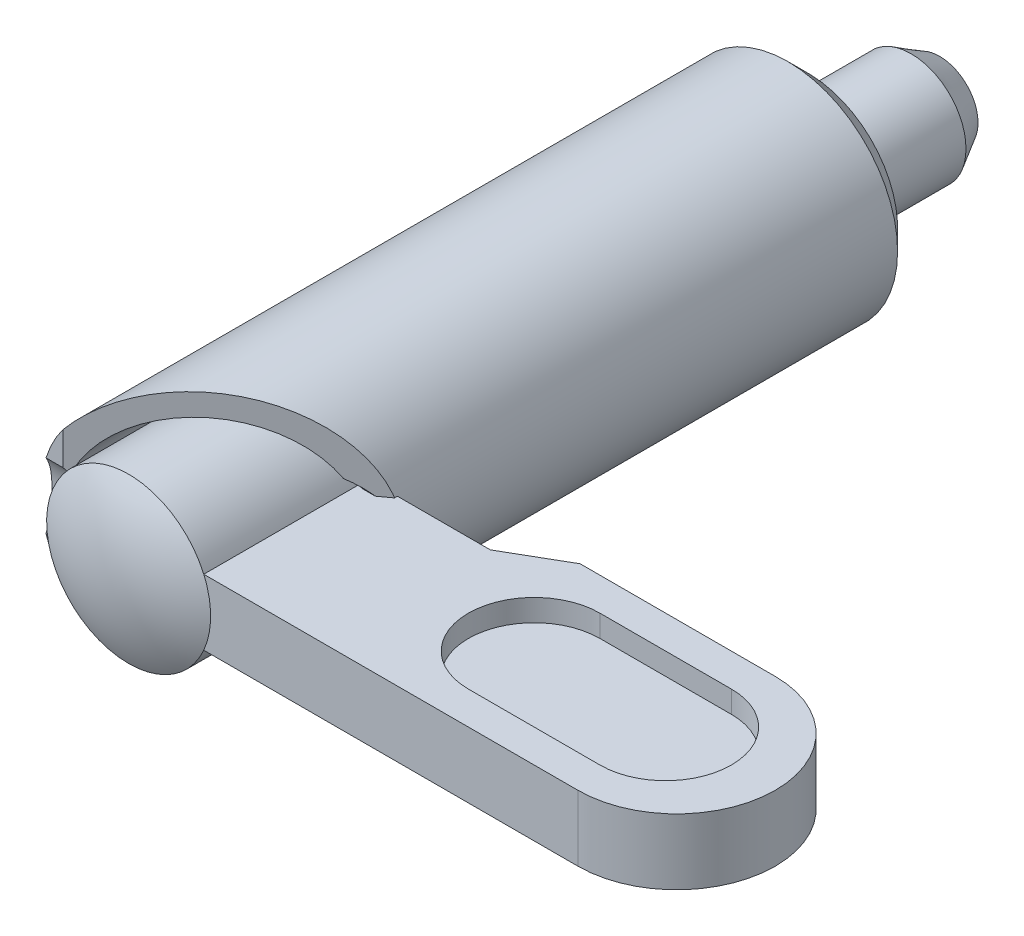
ISO-10303-21;
HEADER;
FILE_DESCRIPTION(('STEP AP214'),'2;1');
FILE_NAME('part.step','',(''),(''),'','','');
FILE_SCHEMA(('AUTOMOTIVE_DESIGN { 1 0 10303 214 1 1 1 1 }'));
ENDSEC;
DATA;
#1=APPLICATION_CONTEXT('core data for automotive mechanical design processes');
#2=APPLICATION_PROTOCOL_DEFINITION('international standard','automotive_design',2000,#1);
#3=PRODUCT_CONTEXT('',#1,'mechanical');
#4=PRODUCT('Part','Part','',(#3));
#5=PRODUCT_RELATED_PRODUCT_CATEGORY('part','',(#4));
#6=PRODUCT_DEFINITION_FORMATION('','',#4);
#7=PRODUCT_DEFINITION_CONTEXT('part definition',#1,'design');
#8=PRODUCT_DEFINITION('design','',#6,#7);
#9=PRODUCT_DEFINITION_SHAPE('','',#8);
#10=(LENGTH_UNIT() NAMED_UNIT(*) SI_UNIT(.MILLI.,.METRE.));
#11=(NAMED_UNIT(*) PLANE_ANGLE_UNIT() SI_UNIT($,.RADIAN.));
#12=(NAMED_UNIT(*) SI_UNIT($,.STERADIAN.) SOLID_ANGLE_UNIT());
#13=UNCERTAINTY_MEASURE_WITH_UNIT(LENGTH_MEASURE(1.E-05),#10,'distance_accuracy_value','');
#14=(GEOMETRIC_REPRESENTATION_CONTEXT(3) GLOBAL_UNCERTAINTY_ASSIGNED_CONTEXT((#13)) GLOBAL_UNIT_ASSIGNED_CONTEXT((#10,
#11,#12)) REPRESENTATION_CONTEXT('',''));
#15=CARTESIAN_POINT('',(0.,0.,0.));
#16=DIRECTION('',(0.,0.,1.));
#17=DIRECTION('',(1.,0.,0.));
#18=AXIS2_PLACEMENT_3D('',#15,#16,#17);
#19=CARTESIAN_POINT('',(-4.,-4.04800210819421,23.));
#20=DIRECTION('',(0.,0.,1.));
#21=DIRECTION('',(1.,0.,0.));
#22=AXIS2_PLACEMENT_3D('',#19,#20,#21);
#23=PLANE('',#22);
#24=CARTESIAN_POINT('',(0.,-1.60608234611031E-13,23.));
#25=DIRECTION('',(0.,0.,1.));
#26=DIRECTION('',(-1.,0.,0.));
#27=AXIS2_PLACEMENT_3D('',#24,#25,#26);
#28=CIRCLE('',#27,4.);
#29=CARTESIAN_POINT('',(-4.,-1.60608234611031E-13,23.));
#30=VERTEX_POINT('',#29);
#31=EDGE_CURVE('E398',#30,#30,#28,.F.);
#32=ORIENTED_EDGE('',*,*,#31,.F.);
#33=EDGE_LOOP('',(#32));
#34=FACE_BOUND('',#33,.T.);
#35=CARTESIAN_POINT('',(0.,-1.60608234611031E-13,23.));
#36=DIRECTION('',(0.,0.,1.));
#37=DIRECTION('',(0.,-1.,0.));
#38=AXIS2_PLACEMENT_3D('',#35,#36,#37);
#39=CIRCLE('',#38,3.74165738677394);
#40=CARTESIAN_POINT('',(0.,-3.7416573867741,23.));
#41=VERTEX_POINT('',#40);
#42=EDGE_CURVE('E325',#41,#41,#39,.F.);
#43=ORIENTED_EDGE('',*,*,#42,.T.);
#44=EDGE_LOOP('',(#43));
#45=FACE_BOUND('',#44,.T.);
#46=ADVANCED_FACE('F14',(#34,#45),#23,.T.);
#47=CARTESIAN_POINT('',(1.74944465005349,-1.77044009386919,-6.));
#48=DIRECTION('',(0.,0.,-1.));
#49=DIRECTION('',(-1.,0.,0.));
#50=AXIS2_PLACEMENT_3D('',#47,#48,#49);
#51=PLANE('',#50);
#52=CARTESIAN_POINT('',(0.,0.,-6.00000000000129));
#53=DIRECTION('',(0.,0.,1.));
#54=DIRECTION('',(0.,-1.,0.));
#55=AXIS2_PLACEMENT_3D('',#52,#53,#54);
#56=CIRCLE('',#55,1.74944465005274);
#57=CARTESIAN_POINT('',(0.,-1.7494446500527,-6.0000000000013));
#58=VERTEX_POINT('',#57);
#59=EDGE_CURVE('E402',#58,#58,#56,.T.);
#60=ORIENTED_EDGE('',*,*,#59,.F.);
#61=EDGE_LOOP('',(#60));
#62=FACE_BOUND('',#61,.T.);
#63=ADVANCED_FACE('F545',(#62),#51,.T.);
#64=CARTESIAN_POINT('',(0.,0.,-6.00000000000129));
#65=DIRECTION('',(0.,0.,1.));
#66=DIRECTION('',(0.,-1.,0.));
#67=AXIS2_PLACEMENT_3D('',#64,#65,#66);
#68=CONICAL_SURFACE('',#67,1.74944465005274,0.523598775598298);
#69=CARTESIAN_POINT('',(0.,0.,-4.70000000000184));
#70=DIRECTION('',(0.,0.,1.));
#71=DIRECTION('',(1.,0.,0.));
#72=AXIS2_PLACEMENT_3D('',#69,#70,#71);
#73=CIRCLE('',#72,2.5);
#74=CARTESIAN_POINT('',(2.5,0.,-4.70000000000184));
#75=VERTEX_POINT('',#74);
#76=EDGE_CURVE('E401',#75,#75,#73,.T.);
#77=ORIENTED_EDGE('',*,*,#76,.F.);
#78=EDGE_LOOP('',(#77));
#79=FACE_BOUND('',#78,.T.);
#80=ORIENTED_EDGE('',*,*,#59,.T.);
#81=EDGE_LOOP('',(#80));
#82=FACE_BOUND('',#81,.T.);
#83=ADVANCED_FACE('F542',(#79,#82),#68,.T.);
#84=CARTESIAN_POINT('',(0.,0.,1.84E-12));
#85=DIRECTION('',(0.,0.,1.));
#86=DIRECTION('',(-1.,0.,0.));
#87=AXIS2_PLACEMENT_3D('',#84,#85,#86);
#88=CYLINDRICAL_SURFACE('',#87,2.5);
#89=CARTESIAN_POINT('',(0.,0.,1.8401079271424E-12));
#90=DIRECTION('',(0.,0.,1.));
#91=DIRECTION('',(-1.,0.,0.));
#92=AXIS2_PLACEMENT_3D('',#89,#90,#91);
#93=CIRCLE('',#92,2.5);
#94=CARTESIAN_POINT('',(-2.5,0.,1.8401079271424E-12));
#95=VERTEX_POINT('',#94);
#96=EDGE_CURVE('E397',#95,#95,#93,.T.);
#97=ORIENTED_EDGE('',*,*,#96,.F.);
#98=EDGE_LOOP('',(#97));
#99=FACE_BOUND('',#98,.T.);
#100=ORIENTED_EDGE('',*,*,#76,.T.);
#101=EDGE_LOOP('',(#100));
#102=FACE_BOUND('',#101,.T.);
#103=ADVANCED_FACE('F536',(#99,#102),#88,.T.);
#104=CARTESIAN_POINT('',(3.41739827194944,-1.81557134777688E-13,26.));
#105=DIRECTION('',(1.,0.,0.));
#106=DIRECTION('',(0.,0.,1.));
#107=AXIS2_PLACEMENT_3D('',#104,#105,#106);
#108=CYLINDRICAL_SURFACE('',#107,2.5);
#109=CARTESIAN_POINT('',(1.50552768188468,-1.81557134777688E-13,26.));
#110=DIRECTION('',(0.587785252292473,0.,0.809016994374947));
#111=DIRECTION('',(0.809016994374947,0.,-0.587785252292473));
#112=AXIS2_PLACEMENT_3D('',#109,#110,#111);
#113=ELLIPSE('',#112,4.2532540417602,2.5);
#114=CARTESIAN_POINT('',(3.41757756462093,2.07850032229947,24.6108144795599));
#115=VERTEX_POINT('',#114);
#116=CARTESIAN_POINT('',(3.4175776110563,-2.07850024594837,24.6108143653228));
#117=VERTEX_POINT('',#116);
#118=EDGE_CURVE('E527',#115,#117,#113,.F.);
#119=ORIENTED_EDGE('',*,*,#118,.F.);
#120=CARTESIAN_POINT('',(3.41757763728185,-2.07850020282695,24.6108143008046));
#121=CARTESIAN_POINT('',(3.44204013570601,-2.0382822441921,24.5506579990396));
#122=CARTESIAN_POINT('',(3.46702816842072,-1.99559149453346,24.4924201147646));
#123=CARTESIAN_POINT('',(3.51739313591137,-1.90541594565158,24.3799384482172));
#124=CARTESIAN_POINT('',(3.54277015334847,-1.85793011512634,24.3256955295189));
#125=CARTESIAN_POINT('',(3.61878673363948,-1.70791915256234,24.1685878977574));
#126=CARTESIAN_POINT('',(3.66899266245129,-1.59834169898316,24.0720930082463));
#127=CARTESIAN_POINT('',(3.76318752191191,-1.36184369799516,23.8983533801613));
#128=CARTESIAN_POINT('',(3.80715987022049,-1.23487859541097,23.8211595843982));
#129=CARTESIAN_POINT('',(3.86468142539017,-1.03397246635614,23.7226206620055));
#130=CARTESIAN_POINT('',(3.88243252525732,-0.965351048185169,23.6926757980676));
#131=CARTESIAN_POINT('',(3.91465106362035,-0.825036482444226,23.6388648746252));
#132=CARTESIAN_POINT('',(3.92911955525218,-0.753344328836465,23.6149968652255));
#133=CARTESIAN_POINT('',(3.96060532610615,-0.57088733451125,23.5634024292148));
#134=CARTESIAN_POINT('',(3.97527425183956,-0.458524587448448,23.5397232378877));
#135=CARTESIAN_POINT('',(3.99497385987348,-0.230783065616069,23.5080192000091));
#136=CARTESIAN_POINT('',(4.00000365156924,-0.115404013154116,23.4999957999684));
#137=CARTESIAN_POINT('',(3.99999597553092,0.127189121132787,23.5000046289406));
#138=CARTESIAN_POINT('',(3.99387798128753,0.254408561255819,23.509760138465));
#139=CARTESIAN_POINT('',(3.97001485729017,0.50480872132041,23.5482170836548));
#140=CARTESIAN_POINT('',(3.95226550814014,0.627987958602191,23.5769253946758));
#141=CARTESIAN_POINT('',(3.9069277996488,0.866361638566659,23.6516052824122));
#142=CARTESIAN_POINT('',(3.8793850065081,0.981590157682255,23.6974969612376));
#143=CARTESIAN_POINT('',(3.81672324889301,1.20242398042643,23.8047166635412));
#144=CARTESIAN_POINT('',(3.7815982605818,1.30802153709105,23.8660569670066));
#145=CARTESIAN_POINT('',(3.70335012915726,1.51609307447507,24.0078705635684));
#146=CARTESIAN_POINT('',(3.65980996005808,1.61762444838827,24.0894897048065));
#147=CARTESIAN_POINT('',(3.57049238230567,1.8062225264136,24.2667111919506));
#148=CARTESIAN_POINT('',(3.52471811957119,1.89330885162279,24.3622942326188));
#149=CARTESIAN_POINT('',(3.45878963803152,2.00962918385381,24.5117102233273));
#150=CARTESIAN_POINT('',(3.43799469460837,2.04494191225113,24.5606138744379));
#151=CARTESIAN_POINT('',(3.41757754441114,2.07850035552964,24.6108145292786));
#152=B_SPLINE_CURVE_WITH_KNOTS('',3,(#120,#121,#122,#123,#124,#125,#126,#127,#128,#129,#130,
#131,#132,#133,#134,#135,#136,#137,#138,#139,#140,#141,#142,#143,#144,#145,#146,#147,#148,#149,
#150,#151),.UNSPECIFIED.,.F.,.F.,(4,2,2,2,2,2,2,2,2,2,2,2,2,2,2,4),(0.,0.229012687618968,
0.458074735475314,0.919031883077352,1.38119312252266,1.61171006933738,1.84215295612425,
2.18792595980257,2.53373090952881,2.91484961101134,3.29610664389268,3.67561251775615,
4.05542101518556,4.46593333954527,4.87588340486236,5.06713931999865),.UNSPECIFIED.);
#153=EDGE_CURVE('E391',#117,#115,#152,.T.);
#154=ORIENTED_EDGE('',*,*,#153,.F.);
#155=EDGE_LOOP('',(#119,#154));
#156=FACE_BOUND('',#155,.T.);
#157=ADVANCED_FACE('F385',(#156),#108,.F.);
#158=CARTESIAN_POINT('',(0.,-1.60608234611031E-13,23.));
#159=DIRECTION('',(0.,0.,1.));
#160=DIRECTION('',(-1.,0.,0.));
#161=AXIS2_PLACEMENT_3D('',#158,#159,#160);
#162=CYLINDRICAL_SURFACE('',#161,4.);
#163=ORIENTED_EDGE('',*,*,#31,.T.);
#164=EDGE_LOOP('',(#163));
#165=FACE_BOUND('',#164,.T.);
#166=CARTESIAN_POINT('',(0.,-1.8919531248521E-13,27.0938298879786));
#167=DIRECTION('',(0.587785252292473,0.,0.809016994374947));
#168=DIRECTION('',(-0.809016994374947,0.,0.587785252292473));
#169=AXIS2_PLACEMENT_3D('',#166,#167,#168);
#170=ELLIPSE('',#169,4.94427190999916,4.);
#171=CARTESIAN_POINT('',(-3.79181860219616,-1.27362166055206,29.8487473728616));
#172=VERTEX_POINT('',#171);
#173=EDGE_CURVE('E351',#117,#172,#170,.F.);
#174=ORIENTED_EDGE('',*,*,#173,.F.);
#175=ORIENTED_EDGE('',*,*,#153,.T.);
#176=CARTESIAN_POINT('',(0.,-1.8919531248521E-13,27.0938298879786));
#177=DIRECTION('',(0.587785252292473,0.,0.809016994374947));
#178=DIRECTION('',(-0.809016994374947,0.,0.587785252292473));
#179=AXIS2_PLACEMENT_3D('',#176,#177,#178);
#180=ELLIPSE('',#179,4.94427190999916,4.);
#181=CARTESIAN_POINT('',(-3.79181855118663,1.27362163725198,29.8487473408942));
#182=VERTEX_POINT('',#181);
#183=EDGE_CURVE('E378',#182,#115,#180,.F.);
#184=ORIENTED_EDGE('',*,*,#183,.F.);
#185=CARTESIAN_POINT('',(-3.79181855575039,-1.2736216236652,29.8487473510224));
#186=CARTESIAN_POINT('',(-3.8095398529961,-1.22088033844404,29.8175186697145));
#187=CARTESIAN_POINT('',(-3.82648052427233,-1.16678047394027,29.7881132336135));
#188=CARTESIAN_POINT('',(-3.85850124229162,-1.05606797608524,29.73316543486));
#189=CARTESIAN_POINT('',(-3.87357976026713,-0.999453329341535,29.7076262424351));
#190=CARTESIAN_POINT('',(-3.90155714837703,-0.883960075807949,29.6606619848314));
#191=CARTESIAN_POINT('',(-3.91445440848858,-0.825079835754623,29.6392399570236));
#192=CARTESIAN_POINT('',(-3.93777055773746,-0.705463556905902,29.6007771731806));
#193=CARTESIAN_POINT('',(-3.94819048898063,-0.644728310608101,29.5837345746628));
#194=CARTESIAN_POINT('',(-3.97122129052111,-0.488422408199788,29.5462420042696));
#195=CARTESIAN_POINT('',(-3.98196601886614,-0.391787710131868,29.5289395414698));
#196=CARTESIAN_POINT('',(-3.99635385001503,-0.196780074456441,29.505822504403));
#197=CARTESIAN_POINT('',(-4.00000558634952,-0.098409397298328,29.4999939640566));
#198=CARTESIAN_POINT('',(-3.99999277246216,0.127320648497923,29.5000078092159));
#199=CARTESIAN_POINT('',(-3.99386362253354,0.254706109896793,29.5097820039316));
#200=CARTESIAN_POINT('',(-3.96991754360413,0.505681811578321,29.5483751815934));
#201=CARTESIAN_POINT('',(-3.95207299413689,0.629262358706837,29.5772391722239));
#202=CARTESIAN_POINT('',(-3.91153904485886,0.841910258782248,29.6440123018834));
#203=CARTESIAN_POINT('',(-3.89083979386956,0.932492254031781,29.6784307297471));
#204=CARTESIAN_POINT('',(-3.84464738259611,1.10766404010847,29.756729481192));
#205=CARTESIAN_POINT('',(-3.81917674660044,1.19227951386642,29.8005654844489));
#206=CARTESIAN_POINT('',(-3.79181855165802,1.27362163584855,29.8487473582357));
#207=B_SPLINE_CURVE_WITH_KNOTS('',3,(#185,#186,#187,#188,#189,#190,#191,#192,#193,#194,#195,
#196,#197,#198,#199,#200,#201,#202,#203,#204,#205,#206),.UNSPECIFIED.,.F.,.F.,(4,2,2,2,2,2,2,2,
2,2,4),(0.,0.191386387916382,0.382928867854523,0.574612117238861,0.766214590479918,
1.06151036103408,1.35644647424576,1.7380305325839,2.12051746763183,2.41704359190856,
2.71220365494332),.UNSPECIFIED.);
#208=EDGE_CURVE('E369',#172,#182,#207,.T.);
#209=ORIENTED_EDGE('',*,*,#208,.F.);
#210=EDGE_LOOP('',(#174,#175,#184,#209));
#211=FACE_BOUND('',#210,.T.);
#212=ADVANCED_FACE('F381',(#165,#211),#162,.F.);
#213=CARTESIAN_POINT('',(-4.76969600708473,-3.00900000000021,30.));
#214=DIRECTION('',(0.,0.,1.));
#215=DIRECTION('',(1.,0.,0.));
#216=AXIS2_PLACEMENT_3D('',#213,#214,#215);
#217=PLANE('',#216);
#218=CARTESIAN_POINT('',(0.,-2.09489001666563E-13,30.));
#219=DIRECTION('',(0.,0.,1.));
#220=DIRECTION('',(-1.,0.,0.));
#221=AXIS2_PLACEMENT_3D('',#218,#219,#220);
#222=CIRCLE('',#221,5.);
#223=CARTESIAN_POINT('',(-4.,-3.00000000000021,30.));
#224=VERTEX_POINT('',#223);
#225=CARTESIAN_POINT('',(-4.76969600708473,-1.5000000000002,30.));
#226=VERTEX_POINT('',#225);
#227=EDGE_CURVE('E379',#224,#226,#222,.F.);
#228=ORIENTED_EDGE('',*,*,#227,.F.);
#229=DIRECTION('',(0.,1.,0.));
#230=VECTOR('',#229,1.);
#231=CARTESIAN_POINT('',(-4.,-5.00000000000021,30.));
#232=LINE('',#231,#230);
#233=CARTESIAN_POINT('',(-4.,-1.50000000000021,30.));
#234=VERTEX_POINT('',#233);
#235=EDGE_CURVE('E504',#234,#224,#232,.F.);
#236=ORIENTED_EDGE('',*,*,#235,.F.);
#237=DIRECTION('',(1.,0.,0.));
#238=VECTOR('',#237,1.);
#239=CARTESIAN_POINT('',(-4.39590657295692,-1.5000000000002,30.));
#240=LINE('',#239,#238);
#241=EDGE_CURVE('E377',#226,#234,#240,.T.);
#242=ORIENTED_EDGE('',*,*,#241,.F.);
#243=EDGE_LOOP('',(#228,#236,#242));
#244=FACE_BOUND('',#243,.T.);
#245=ADVANCED_FACE('F363',(#244),#217,.T.);
#246=CARTESIAN_POINT('',(-3.79166167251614,-2.23454935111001E-13,32.));
#247=DIRECTION('',(-1.,0.,0.));
#248=DIRECTION('',(0.,0.,-1.));
#249=AXIS2_PLACEMENT_3D('',#246,#247,#248);
#250=CYLINDRICAL_SURFACE('',#249,2.5);
#251=DIRECTION('',(1.,0.,0.));
#252=VECTOR('',#251,1.);
#253=CARTESIAN_POINT('',(-4.38484800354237,1.49999999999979,30.));
#254=LINE('',#253,#252);
#255=CARTESIAN_POINT('',(-4.76969600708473,1.49999999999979,30.));
#256=VERTEX_POINT('',#255);
#257=CARTESIAN_POINT('',(-4.,1.49999999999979,30.));
#258=VERTEX_POINT('',#257);
#259=EDGE_CURVE('E376',#256,#258,#254,.T.);
#260=ORIENTED_EDGE('',*,*,#259,.F.);
#261=CARTESIAN_POINT('',(-4.76969600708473,-1.5000000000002,30.));
#262=CARTESIAN_POINT('',(-4.78628364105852,-1.44725770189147,29.9604486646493));
#263=CARTESIAN_POINT('',(-4.80241993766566,-1.39288339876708,29.9229244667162));
#264=CARTESIAN_POINT('',(-4.83345362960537,-1.28105388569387,29.8521424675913));
#265=CARTESIAN_POINT('',(-4.84835043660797,-1.22359723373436,29.8188866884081));
#266=CARTESIAN_POINT('',(-4.8907237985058,-1.04666316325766,29.7257396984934));
#267=CARTESIAN_POINT('',(-4.91579736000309,-0.92288596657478,29.6726678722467));
#268=CARTESIAN_POINT('',(-4.95685736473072,-0.667928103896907,29.5871516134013));
#269=CARTESIAN_POINT('',(-4.97290389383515,-0.536802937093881,29.5545706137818));
#270=CARTESIAN_POINT('',(-4.99446093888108,-0.270438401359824,29.5110234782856));
#271=CARTESIAN_POINT('',(-4.99999752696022,-0.135210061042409,29.5000038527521));
#272=CARTESIAN_POINT('',(-5.00000240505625,0.131493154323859,29.4999962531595));
#273=CARTESIAN_POINT('',(-4.9947707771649,0.262969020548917,29.5104109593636));
#274=CARTESIAN_POINT('',(-4.97435424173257,0.522235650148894,29.5516285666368));
#275=CARTESIAN_POINT('',(-4.95914613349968,0.650017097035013,29.5824789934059));
#276=CARTESIAN_POINT('',(-4.9294194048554,0.839830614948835,29.6442592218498));
#277=CARTESIAN_POINT('',(-4.91790654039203,0.904656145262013,29.6684002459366));
#278=CARTESIAN_POINT('',(-4.8928123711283,1.03178245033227,29.7218052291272));
#279=CARTESIAN_POINT('',(-4.87923058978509,1.09408263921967,29.7510703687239));
#280=CARTESIAN_POINT('',(-4.85039065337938,1.21556462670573,29.8143462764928));
#281=CARTESIAN_POINT('',(-4.83513749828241,1.27475498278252,29.8483429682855));
#282=CARTESIAN_POINT('',(-4.80331217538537,1.38988155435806,29.9208518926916));
#283=CARTESIAN_POINT('',(-4.78674075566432,1.44581958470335,29.9593615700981));
#284=CARTESIAN_POINT('',(-4.76969600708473,1.49999999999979,30.));
#285=B_SPLINE_CURVE_WITH_KNOTS('',3,(#261,#262,#263,#264,#265,#266,#267,#268,#269,#270,#271,
#272,#273,#274,#275,#276,#277,#278,#279,#280,#281,#282,#283,#284),.UNSPECIFIED.,.F.,.F.,(4,2,2,
2,2,2,2,2,2,2,2,4),(0.,0.203834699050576,0.407765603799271,0.816641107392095,1.22276183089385,
1.62787376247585,2.02184922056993,2.4167441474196,2.62690127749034,2.83710688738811,
3.04669999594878,3.25617500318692),.UNSPECIFIED.);
#286=EDGE_CURVE('E342',#226,#256,#285,.T.);
#287=ORIENTED_EDGE('',*,*,#286,.F.);
#288=ORIENTED_EDGE('',*,*,#241,.T.);
#289=CARTESIAN_POINT('',(-3.79181856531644,-1.2736215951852,29.8487473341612));
#290=CARTESIAN_POINT('',(-3.79981247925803,-1.28343141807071,29.854555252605));
#291=CARTESIAN_POINT('',(-3.8078680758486,-1.29316433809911,29.8604079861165));
#292=CARTESIAN_POINT('',(-3.82415540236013,-1.31254535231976,29.8722414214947));
#293=CARTESIAN_POINT('',(-3.83238797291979,-1.32219236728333,29.8782227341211));
#294=CARTESIAN_POINT('',(-3.84902922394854,-1.34140157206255,29.8903133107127));
#295=CARTESIAN_POINT('',(-3.85743874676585,-1.35096264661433,29.8964231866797));
#296=CARTESIAN_POINT('',(-3.87443390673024,-1.37000001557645,29.908770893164));
#297=CARTESIAN_POINT('',(-3.88302038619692,-1.37947516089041,29.9150093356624));
#298=CARTESIAN_POINT('',(-3.90036945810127,-1.39834070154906,29.9276141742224));
#299=CARTESIAN_POINT('',(-3.90913289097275,-1.40772991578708,29.9339811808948));
#300=CARTESIAN_POINT('',(-3.92683587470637,-1.42642362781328,29.9468431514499));
#301=CARTESIAN_POINT('',(-3.9357762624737,-1.43572691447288,29.9533387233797));
#302=CARTESIAN_POINT('',(-3.95383315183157,-1.45424879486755,29.9664578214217));
#303=CARTESIAN_POINT('',(-3.96295048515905,-1.46346614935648,29.9730819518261));
#304=CARTESIAN_POINT('',(-3.98136130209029,-1.48181621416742,29.986458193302));
#305=CARTESIAN_POINT('',(-3.99065561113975,-1.49094765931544,29.9932109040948));
#306=CARTESIAN_POINT('',(-4.,-1.50000000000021,30.));
#307=B_SPLINE_CURVE_WITH_KNOTS('',3,(#289,#290,#291,#292,#293,#294,#295,#296,#297,#298,#299,
#300,#301,#302,#303,#304,#305,#306),.UNSPECIFIED.,.F.,.F.,(4,2,2,2,2,2,2,2,4),(0.,
0.0417703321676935,0.0838346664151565,0.126202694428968,0.16888390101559,0.211887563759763,
0.255222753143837,0.298898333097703,0.342922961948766),.UNSPECIFIED.);
#308=EDGE_CURVE('E482',#172,#234,#307,.T.);
#309=ORIENTED_EDGE('',*,*,#308,.F.);
#310=ORIENTED_EDGE('',*,*,#208,.T.);
#311=CARTESIAN_POINT('',(-4.,1.49999999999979,30.));
#312=CARTESIAN_POINT('',(-3.99065561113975,1.49094765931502,29.9932109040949));
#313=CARTESIAN_POINT('',(-3.98136130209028,1.481816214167,29.986458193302));
#314=CARTESIAN_POINT('',(-3.96295048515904,1.46346614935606,29.9730819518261));
#315=CARTESIAN_POINT('',(-3.95383315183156,1.45424879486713,29.9664578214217));
#316=CARTESIAN_POINT('',(-3.93577626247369,1.43572691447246,29.9533387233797));
#317=CARTESIAN_POINT('',(-3.92683587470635,1.42642362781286,29.9468431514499));
#318=CARTESIAN_POINT('',(-3.90913289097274,1.40772991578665,29.9339811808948));
#319=CARTESIAN_POINT('',(-3.90036945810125,1.39834070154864,29.9276141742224));
#320=CARTESIAN_POINT('',(-3.88302038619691,1.37947516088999,29.9150093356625));
#321=CARTESIAN_POINT('',(-3.87443390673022,1.37000001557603,29.9087708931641));
#322=CARTESIAN_POINT('',(-3.85743874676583,1.35096264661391,29.8964231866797));
#323=CARTESIAN_POINT('',(-3.84902922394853,1.34140157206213,29.8903133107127));
#324=CARTESIAN_POINT('',(-3.83238797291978,1.32219236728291,29.8782227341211));
#325=CARTESIAN_POINT('',(-3.82415540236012,1.31254535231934,29.8722414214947));
#326=CARTESIAN_POINT('',(-3.8078680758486,1.29316433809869,29.8604079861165));
#327=CARTESIAN_POINT('',(-3.79981247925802,1.28343141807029,29.854555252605));
#328=CARTESIAN_POINT('',(-3.79181856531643,1.27362159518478,29.8487473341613));
#329=B_SPLINE_CURVE_WITH_KNOTS('',3,(#311,#312,#313,#314,#315,#316,#317,#318,#319,#320,#321,
#322,#323,#324,#325,#326,#327,#328),.UNSPECIFIED.,.F.,.F.,(4,2,2,2,2,2,2,2,4),(0.,
0.0440246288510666,0.0877002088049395,0.131035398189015,0.174039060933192,0.216720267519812,
0.259088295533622,0.301152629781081,0.342922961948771),.UNSPECIFIED.);
#330=EDGE_CURVE('E508',#258,#182,#329,.T.);
#331=ORIENTED_EDGE('',*,*,#330,.F.);
#332=EDGE_LOOP('',(#260,#287,#288,#309,#310,#331));
#333=FACE_BOUND('',#332,.T.);
#334=ADVANCED_FACE('F357',(#333),#250,.F.);
#335=CARTESIAN_POINT('',(-4.76969600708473,1.49999999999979,30.));
#336=DIRECTION('',(0.,0.,1.));
#337=DIRECTION('',(1.,0.,0.));
#338=AXIS2_PLACEMENT_3D('',#335,#336,#337);
#339=PLANE('',#338);
#340=DIRECTION('',(0.,1.,0.));
#341=VECTOR('',#340,1.);
#342=CARTESIAN_POINT('',(-4.,-5.00000000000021,30.));
#343=LINE('',#342,#341);
#344=CARTESIAN_POINT('',(-4.,2.99999999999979,30.));
#345=VERTEX_POINT('',#344);
#346=EDGE_CURVE('E34',#345,#258,#343,.F.);
#347=ORIENTED_EDGE('',*,*,#346,.F.);
#348=CARTESIAN_POINT('',(0.,-2.09489001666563E-13,30.));
#349=DIRECTION('',(0.,0.,1.));
#350=DIRECTION('',(-1.,0.,0.));
#351=AXIS2_PLACEMENT_3D('',#348,#349,#350);
#352=CIRCLE('',#351,5.);
#353=EDGE_CURVE('E339',#256,#345,#352,.F.);
#354=ORIENTED_EDGE('',*,*,#353,.F.);
#355=ORIENTED_EDGE('',*,*,#259,.T.);
#356=EDGE_LOOP('',(#347,#354,#355));
#357=FACE_BOUND('',#356,.T.);
#358=ADVANCED_FACE('F362',(#357),#339,.T.);
#359=CARTESIAN_POINT('',(-4.,-5.06630126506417,30.));
#360=DIRECTION('',(0.587785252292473,0.,0.809016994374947));
#361=DIRECTION('',(0.809016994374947,0.,-0.587785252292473));
#362=AXIS2_PLACEMENT_3D('',#359,#360,#361);
#363=PLANE('',#362);
#364=CARTESIAN_POINT('',(0.,-1.8919531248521E-13,27.0938298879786));
#365=DIRECTION('',(0.587785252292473,0.,0.809016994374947));
#366=DIRECTION('',(-0.809016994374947,0.,0.587785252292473));
#367=AXIS2_PLACEMENT_3D('',#364,#365,#366);
#368=ELLIPSE('',#367,6.18033988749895,5.);
#369=EDGE_CURVE('E337',#345,#224,#368,.F.);
#370=ORIENTED_EDGE('',*,*,#369,.F.);
#371=ORIENTED_EDGE('',*,*,#346,.T.);
#372=ORIENTED_EDGE('',*,*,#330,.T.);
#373=ORIENTED_EDGE('',*,*,#183,.T.);
#374=ORIENTED_EDGE('',*,*,#118,.T.);
#375=ORIENTED_EDGE('',*,*,#173,.T.);
#376=ORIENTED_EDGE('',*,*,#308,.T.);
#377=ORIENTED_EDGE('',*,*,#235,.T.);
#378=EDGE_LOOP('',(#370,#371,#372,#373,#374,#375,#376,#377));
#379=FACE_BOUND('',#378,.T.);
#380=ADVANCED_FACE('F492',(#379),#363,.T.);
#381=CARTESIAN_POINT('',(4.08,-4.12896210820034,0.));
#382=DIRECTION('',(0.,0.,-1.));
#383=DIRECTION('',(-1.,0.,0.));
#384=AXIS2_PLACEMENT_3D('',#381,#382,#383);
#385=PLANE('',#384);
#386=CARTESIAN_POINT('',(0.,0.,0.));
#387=DIRECTION('',(0.,0.,1.));
#388=DIRECTION('',(-1.,0.,0.));
#389=AXIS2_PLACEMENT_3D('',#386,#387,#388);
#390=CIRCLE('',#389,4.08);
#391=CARTESIAN_POINT('',(-4.08,0.,0.));
#392=VERTEX_POINT('',#391);
#393=EDGE_CURVE('E25',#392,#392,#390,.T.);
#394=ORIENTED_EDGE('',*,*,#393,.F.);
#395=EDGE_LOOP('',(#394));
#396=FACE_BOUND('',#395,.T.);
#397=ORIENTED_EDGE('',*,*,#96,.T.);
#398=EDGE_LOOP('',(#397));
#399=FACE_BOUND('',#398,.T.);
#400=ADVANCED_FACE('F491',(#396,#399),#385,.T.);
#401=CARTESIAN_POINT('',(0.,-2.09489001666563E-13,30.));
#402=DIRECTION('',(0.,0.,1.));
#403=DIRECTION('',(-1.,0.,0.));
#404=AXIS2_PLACEMENT_3D('',#401,#402,#403);
#405=CYLINDRICAL_SURFACE('',#404,5.);
#406=CARTESIAN_POINT('',(0.,0.,0.92000000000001));
#407=DIRECTION('',(0.,0.,-1.));
#408=DIRECTION('',(1.,0.,0.));
#409=AXIS2_PLACEMENT_3D('',#406,#407,#408);
#410=CIRCLE('',#409,5.);
#411=CARTESIAN_POINT('',(5.,0.,0.92000000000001));
#412=VERTEX_POINT('',#411);
#413=EDGE_CURVE('E9',#412,#412,#410,.T.);
#414=ORIENTED_EDGE('',*,*,#413,.F.);
#415=EDGE_LOOP('',(#414));
#416=FACE_BOUND('',#415,.T.);
#417=ORIENTED_EDGE('',*,*,#353,.T.);
#418=ORIENTED_EDGE('',*,*,#369,.T.);
#419=ORIENTED_EDGE('',*,*,#227,.T.);
#420=ORIENTED_EDGE('',*,*,#286,.T.);
#421=EDGE_LOOP('',(#417,#418,#419,#420));
#422=FACE_BOUND('',#421,.T.);
#423=ADVANCED_FACE('F353',(#416,#422),#405,.T.);
#424=CARTESIAN_POINT('',(0.,0.,0.));
#425=DIRECTION('',(0.,0.,1.));
#426=DIRECTION('',(-1.,0.,0.));
#427=AXIS2_PLACEMENT_3D('',#424,#425,#426);
#428=CONICAL_SURFACE('',#427,4.08,0.785398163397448);
#429=ORIENTED_EDGE('',*,*,#413,.T.);
#430=EDGE_LOOP('',(#429));
#431=FACE_BOUND('',#430,.T.);
#432=ORIENTED_EDGE('',*,*,#393,.T.);
#433=EDGE_LOOP('',(#432));
#434=FACE_BOUND('',#433,.T.);
#435=ADVANCED_FACE('F548',(#431,#434),#428,.T.);
#436=CARTESIAN_POINT('',(23.12,0.499999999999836,23.5));
#437=CARTESIAN_POINT('',(23.,0.499999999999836,23.5));
#438=CARTESIAN_POINT('',(11.,0.499999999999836,23.5));
#439=CARTESIAN_POINT('',(10.8788,0.499999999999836,23.5));
#440=B_SPLINE_CURVE_WITH_KNOTS('',1,(#436,#437,#438,#439),.UNSPECIFIED.,.F.,.F.,(2,1,1,2),
(-0.01,0.,1.,1.0101),.UNSPECIFIED.);
#441=DIRECTION('',(0.,0.,1.));
#442=VECTOR('',#441,1.);
#443=SURFACE_OF_LINEAR_EXTRUSION('',#440,#442);
#444=DIRECTION('',(1.,0.,0.));
#445=VECTOR('',#444,1.);
#446=CARTESIAN_POINT('',(17.,0.499999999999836,23.5));
#447=LINE('',#446,#445);
#448=CARTESIAN_POINT('',(14.,0.499999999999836,23.5));
#449=VERTEX_POINT('',#448);
#450=CARTESIAN_POINT('',(20.,0.499999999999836,23.5));
#451=VERTEX_POINT('',#450);
#452=EDGE_CURVE('E249',#449,#451,#447,.T.);
#453=ORIENTED_EDGE('',*,*,#452,.F.);
#454=CARTESIAN_POINT('',(14.,0.499999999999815,26.5));
#455=DIRECTION('',(0.,-1.,0.));
#456=DIRECTION('',(0.,0.,-1.));
#457=AXIS2_PLACEMENT_3D('',#454,#455,#456);
#458=CIRCLE('',#457,3.);
#459=CARTESIAN_POINT('',(14.,0.499999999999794,29.5));
#460=VERTEX_POINT('',#459);
#461=EDGE_CURVE('E19',#460,#449,#458,.T.);
#462=ORIENTED_EDGE('',*,*,#461,.F.);
#463=DIRECTION('',(-1.,0.,0.));
#464=VECTOR('',#463,1.);
#465=CARTESIAN_POINT('',(17.,0.499999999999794,29.5));
#466=LINE('',#465,#464);
#467=CARTESIAN_POINT('',(20.,0.499999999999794,29.5));
#468=VERTEX_POINT('',#467);
#469=EDGE_CURVE('E318',#468,#460,#466,.T.);
#470=ORIENTED_EDGE('',*,*,#469,.F.);
#471=CARTESIAN_POINT('',(20.,0.499999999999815,26.5));
#472=DIRECTION('',(0.,-1.,0.));
#473=DIRECTION('',(0.,0.,-1.));
#474=AXIS2_PLACEMENT_3D('',#471,#472,#473);
#475=CIRCLE('',#474,3.);
#476=EDGE_CURVE('E243',#451,#468,#475,.T.);
#477=ORIENTED_EDGE('',*,*,#476,.F.);
#478=EDGE_LOOP('',(#453,#462,#470,#477));
#479=FACE_BOUND('',#478,.T.);
#480=ADVANCED_FACE('F16',(#479),#443,.T.);
#481=CARTESIAN_POINT('',(10.8788,-0.500000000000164,23.5));
#482=CARTESIAN_POINT('',(11.,-0.500000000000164,23.5));
#483=CARTESIAN_POINT('',(23.,-0.500000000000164,23.5));
#484=CARTESIAN_POINT('',(23.12,-0.500000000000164,23.5));
#485=B_SPLINE_CURVE_WITH_KNOTS('',1,(#481,#482,#483,#484),.UNSPECIFIED.,.F.,.F.,(2,1,1,2),
(-0.0101,0.,1.,1.01),.UNSPECIFIED.);
#486=DIRECTION('',(0.,0.,1.));
#487=VECTOR('',#486,1.);
#488=SURFACE_OF_LINEAR_EXTRUSION('',#485,#487);
#489=DIRECTION('',(1.,0.,0.));
#490=VECTOR('',#489,1.);
#491=CARTESIAN_POINT('',(17.,-0.500000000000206,29.5));
#492=LINE('',#491,#490);
#493=CARTESIAN_POINT('',(14.,-0.500000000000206,29.5));
#494=VERTEX_POINT('',#493);
#495=CARTESIAN_POINT('',(20.,-0.500000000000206,29.5));
#496=VERTEX_POINT('',#495);
#497=EDGE_CURVE('E226',#494,#496,#492,.T.);
#498=ORIENTED_EDGE('',*,*,#497,.F.);
#499=CARTESIAN_POINT('',(14.,-0.500000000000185,26.5));
#500=DIRECTION('',(0.,1.,0.));
#501=DIRECTION('',(0.,0.,1.));
#502=AXIS2_PLACEMENT_3D('',#499,#500,#501);
#503=CIRCLE('',#502,3.);
#504=CARTESIAN_POINT('',(14.,-0.500000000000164,23.5));
#505=VERTEX_POINT('',#504);
#506=EDGE_CURVE('E230',#505,#494,#503,.T.);
#507=ORIENTED_EDGE('',*,*,#506,.F.);
#508=DIRECTION('',(-1.,0.,0.));
#509=VECTOR('',#508,1.);
#510=CARTESIAN_POINT('',(17.,-0.500000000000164,23.5));
#511=LINE('',#510,#509);
#512=CARTESIAN_POINT('',(20.,-0.500000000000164,23.5));
#513=VERTEX_POINT('',#512);
#514=EDGE_CURVE('E233',#513,#505,#511,.T.);
#515=ORIENTED_EDGE('',*,*,#514,.F.);
#516=CARTESIAN_POINT('',(20.,-0.500000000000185,26.5));
#517=DIRECTION('',(0.,1.,0.));
#518=DIRECTION('',(0.,0.,1.));
#519=AXIS2_PLACEMENT_3D('',#516,#517,#518);
#520=CIRCLE('',#519,3.);
#521=EDGE_CURVE('E219',#496,#513,#520,.T.);
#522=ORIENTED_EDGE('',*,*,#521,.F.);
#523=EDGE_LOOP('',(#498,#507,#515,#522));
#524=FACE_BOUND('',#523,.T.);
#525=ADVANCED_FACE('F265',(#524),#488,.T.);
#526=CARTESIAN_POINT('',(14.,1.49999999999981,26.5));
#527=DIRECTION('',(0.,-1.,0.));
#528=DIRECTION('',(0.,0.,-1.));
#529=AXIS2_PLACEMENT_3D('',#526,#527,#528);
#530=CYLINDRICAL_SURFACE('',#529,3.);
#531=CARTESIAN_POINT('',(14.,1.49999999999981,26.5));
#532=DIRECTION('',(0.,-1.,0.));
#533=DIRECTION('',(0.,0.,-1.));
#534=AXIS2_PLACEMENT_3D('',#531,#532,#533);
#535=CIRCLE('',#534,3.);
#536=CARTESIAN_POINT('',(14.,1.49999999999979,29.5));
#537=VERTEX_POINT('',#536);
#538=CARTESIAN_POINT('',(14.,1.49999999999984,23.5));
#539=VERTEX_POINT('',#538);
#540=EDGE_CURVE('E323',#537,#539,#535,.T.);
#541=ORIENTED_EDGE('',*,*,#540,.F.);
#542=DIRECTION('',(0.,-1.,0.));
#543=VECTOR('',#542,1.);
#544=CARTESIAN_POINT('',(14.,0.999999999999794,29.5));
#545=LINE('',#544,#543);
#546=EDGE_CURVE('E250',#537,#460,#545,.T.);
#547=ORIENTED_EDGE('',*,*,#546,.T.);
#548=ORIENTED_EDGE('',*,*,#461,.T.);
#549=DIRECTION('',(0.,-1.,0.));
#550=VECTOR('',#549,1.);
#551=CARTESIAN_POINT('',(14.,1.49999999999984,23.5));
#552=LINE('',#551,#550);
#553=EDGE_CURVE('E246',#539,#449,#552,.T.);
#554=ORIENTED_EDGE('',*,*,#553,.F.);
#555=EDGE_LOOP('',(#541,#547,#548,#554));
#556=FACE_BOUND('',#555,.T.);
#557=ADVANCED_FACE('F268',(#556),#530,.F.);
#558=CARTESIAN_POINT('',(14.,1.49999999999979,29.5));
#559=DIRECTION('',(0.,0.,-1.));
#560=DIRECTION('',(1.,0.,0.));
#561=AXIS2_PLACEMENT_3D('',#558,#559,#560);
#562=PLANE('',#561);
#563=DIRECTION('',(-1.,0.,0.));
#564=VECTOR('',#563,1.);
#565=CARTESIAN_POINT('',(14.3217745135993,1.49999999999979,29.5));
#566=LINE('',#565,#564);
#567=CARTESIAN_POINT('',(20.,1.49999999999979,29.5));
#568=VERTEX_POINT('',#567);
#569=EDGE_CURVE('E418',#568,#537,#566,.T.);
#570=ORIENTED_EDGE('',*,*,#569,.F.);
#571=DIRECTION('',(0.,1.,0.));
#572=VECTOR('',#571,1.);
#573=CARTESIAN_POINT('',(20.,0.999999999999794,29.5));
#574=LINE('',#573,#572);
#575=EDGE_CURVE('E240',#468,#568,#574,.T.);
#576=ORIENTED_EDGE('',*,*,#575,.F.);
#577=ORIENTED_EDGE('',*,*,#469,.T.);
#578=ORIENTED_EDGE('',*,*,#546,.F.);
#579=EDGE_LOOP('',(#570,#576,#577,#578));
#580=FACE_BOUND('',#579,.T.);
#581=ADVANCED_FACE('F270',(#580),#562,.T.);
#582=CARTESIAN_POINT('',(20.,1.49999999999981,26.5));
#583=DIRECTION('',(0.,-1.,0.));
#584=DIRECTION('',(0.,0.,-1.));
#585=AXIS2_PLACEMENT_3D('',#582,#583,#584);
#586=CYLINDRICAL_SURFACE('',#585,3.);
#587=CARTESIAN_POINT('',(20.,1.49999999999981,26.5));
#588=DIRECTION('',(0.,-1.,0.));
#589=DIRECTION('',(0.,0.,-1.));
#590=AXIS2_PLACEMENT_3D('',#587,#588,#589);
#591=CIRCLE('',#590,3.);
#592=CARTESIAN_POINT('',(20.,1.49999999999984,23.5));
#593=VERTEX_POINT('',#592);
#594=EDGE_CURVE('E161',#593,#568,#591,.T.);
#595=ORIENTED_EDGE('',*,*,#594,.F.);
#596=DIRECTION('',(0.,-1.,0.));
#597=VECTOR('',#596,1.);
#598=CARTESIAN_POINT('',(20.,0.999999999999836,23.5));
#599=LINE('',#598,#597);
#600=EDGE_CURVE('E236',#593,#451,#599,.T.);
#601=ORIENTED_EDGE('',*,*,#600,.T.);
#602=ORIENTED_EDGE('',*,*,#476,.T.);
#603=ORIENTED_EDGE('',*,*,#575,.T.);
#604=EDGE_LOOP('',(#595,#601,#602,#603));
#605=FACE_BOUND('',#604,.T.);
#606=ADVANCED_FACE('F273',(#605),#586,.F.);
#607=CARTESIAN_POINT('',(20.,1.49999999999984,23.5));
#608=DIRECTION('',(0.,0.,1.));
#609=DIRECTION('',(-1.,0.,0.));
#610=AXIS2_PLACEMENT_3D('',#607,#608,#609);
#611=PLANE('',#610);
#612=DIRECTION('',(1.,0.,0.));
#613=VECTOR('',#612,1.);
#614=CARTESIAN_POINT('',(14.3217745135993,1.49999999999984,23.5));
#615=LINE('',#614,#613);
#616=EDGE_CURVE('E190',#539,#593,#615,.T.);
#617=ORIENTED_EDGE('',*,*,#616,.F.);
#618=ORIENTED_EDGE('',*,*,#553,.T.);
#619=ORIENTED_EDGE('',*,*,#452,.T.);
#620=ORIENTED_EDGE('',*,*,#600,.F.);
#621=EDGE_LOOP('',(#617,#618,#619,#620));
#622=FACE_BOUND('',#621,.T.);
#623=ADVANCED_FACE('F278',(#622),#611,.T.);
#624=CARTESIAN_POINT('',(20.5,-1.50000000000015,22.));
#625=DIRECTION('',(0.,0.,-1.));
#626=DIRECTION('',(-1.,0.,0.));
#627=AXIS2_PLACEMENT_3D('',#624,#625,#626);
#628=PLANE('',#627);
#629=DIRECTION('',(1.,0.,0.));
#630=VECTOR('',#629,1.);
#631=CARTESIAN_POINT('',(14.3217745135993,-1.50000000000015,22.));
#632=LINE('',#631,#630);
#633=CARTESIAN_POINT('',(11.6,-1.50000000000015,22.));
#634=VERTEX_POINT('',#633);
#635=CARTESIAN_POINT('',(20.5,-1.50000000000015,22.));
#636=VERTEX_POINT('',#635);
#637=EDGE_CURVE('E417',#634,#636,#632,.T.);
#638=ORIENTED_EDGE('',*,*,#637,.F.);
#639=DIRECTION('',(0.,1.,0.));
#640=VECTOR('',#639,1.);
#641=CARTESIAN_POINT('',(11.6,-1.50000000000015,22.));
#642=LINE('',#641,#640);
#643=CARTESIAN_POINT('',(11.6,1.49999999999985,22.));
#644=VERTEX_POINT('',#643);
#645=EDGE_CURVE('E160',#644,#634,#642,.F.);
#646=ORIENTED_EDGE('',*,*,#645,.F.);
#647=DIRECTION('',(-1.,0.,0.));
#648=VECTOR('',#647,1.);
#649=CARTESIAN_POINT('',(14.3217745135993,1.49999999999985,22.));
#650=LINE('',#649,#648);
#651=CARTESIAN_POINT('',(20.5,1.49999999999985,22.));
#652=VERTEX_POINT('',#651);
#653=EDGE_CURVE('E157',#652,#644,#650,.T.);
#654=ORIENTED_EDGE('',*,*,#653,.F.);
#655=DIRECTION('',(0.,1.,0.));
#656=VECTOR('',#655,1.);
#657=CARTESIAN_POINT('',(20.5,-1.53625267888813E-13,22.));
#658=LINE('',#657,#656);
#659=EDGE_CURVE('E234',#636,#652,#658,.T.);
#660=ORIENTED_EDGE('',*,*,#659,.F.);
#661=EDGE_LOOP('',(#638,#646,#654,#660));
#662=FACE_BOUND('',#661,.T.);
#663=ADVANCED_FACE('F281',(#662),#628,.T.);
#664=CARTESIAN_POINT('',(3.42782730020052,-1.50000000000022,31.));
#665=DIRECTION('',(0.,0.,1.));
#666=DIRECTION('',(1.,0.,0.));
#667=AXIS2_PLACEMENT_3D('',#664,#665,#666);
#668=PLANE('',#667);
#669=DIRECTION('',(0.,1.,0.));
#670=VECTOR('',#669,1.);
#671=CARTESIAN_POINT('',(20.5,-1.50000000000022,31.));
#672=LINE('',#671,#670);
#673=CARTESIAN_POINT('',(20.5,-1.50000000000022,31.));
#674=VERTEX_POINT('',#673);
#675=CARTESIAN_POINT('',(20.5,1.49999999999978,31.));
#676=VERTEX_POINT('',#675);
#677=EDGE_CURVE('E231',#674,#676,#672,.T.);
#678=ORIENTED_EDGE('',*,*,#677,.T.);
#679=DIRECTION('',(1.,0.,0.));
#680=VECTOR('',#679,1.);
#681=CARTESIAN_POINT('',(14.3217745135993,1.49999999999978,31.));
#682=LINE('',#681,#680);
#683=CARTESIAN_POINT('',(3.42782730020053,1.49999999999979,31.0000000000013));
#684=VERTEX_POINT('',#683);
#685=EDGE_CURVE('E422',#684,#676,#682,.T.);
#686=ORIENTED_EDGE('',*,*,#685,.F.);
#687=CARTESIAN_POINT('',(3.42782730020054,-1.50000000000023,31.));
#688=CARTESIAN_POINT('',(3.47000498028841,-1.40364028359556,31.));
#689=CARTESIAN_POINT('',(3.50809870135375,-1.30549843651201,31.));
#690=CARTESIAN_POINT('',(3.57589326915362,-1.10635930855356,31.));
#691=CARTESIAN_POINT('',(3.60559427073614,-1.00536208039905,31.));
#692=CARTESIAN_POINT('',(3.65638602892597,-0.801193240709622,31.));
#693=CARTESIAN_POINT('',(3.67747474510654,-0.698021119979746,31.));
#694=CARTESIAN_POINT('',(3.710887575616,-0.49029795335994,31.));
#695=CARTESIAN_POINT('',(3.72321206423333,-0.385746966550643,31.));
#696=CARTESIAN_POINT('',(3.74688800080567,-0.0709807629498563,31.));
#697=CARTESIAN_POINT('',(3.74495049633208,0.14038231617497,31.));
#698=CARTESIAN_POINT('',(3.70556982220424,0.55943701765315,31.));
#699=CARTESIAN_POINT('',(3.66818371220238,0.767133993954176,31.));
#700=CARTESIAN_POINT('',(3.58941923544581,1.06061054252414,31.));
#701=CARTESIAN_POINT('',(3.56170810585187,1.15023176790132,31.));
#702=CARTESIAN_POINT('',(3.49968016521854,1.32702391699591,31.));
#703=CARTESIAN_POINT('',(3.46537223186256,1.4141979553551,31.));
#704=CARTESIAN_POINT('',(3.42782730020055,1.49999999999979,31.));
#705=B_SPLINE_CURVE_WITH_KNOTS('',3,(#687,#688,#689,#690,#691,#692,#693,#694,#695,#696,#697,
#698,#699,#700,#701,#702,#703,#704),.UNSPECIFIED.,.F.,.F.,(4,2,2,2,2,2,2,2,4),(0.,
0.315456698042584,0.630907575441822,0.946433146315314,1.26194524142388,1.89286379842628,
2.5227685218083,2.80396781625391,3.08479130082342),.UNSPECIFIED.);
#706=CARTESIAN_POINT('',(3.42782730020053,-1.50000000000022,31.0000000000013));
#707=VERTEX_POINT('',#706);
#708=EDGE_CURVE('E222',#707,#684,#705,.T.);
#709=ORIENTED_EDGE('',*,*,#708,.F.);
#710=DIRECTION('',(-1.,0.,0.));
#711=VECTOR('',#710,1.);
#712=CARTESIAN_POINT('',(14.3217745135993,-1.50000000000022,31.));
#713=LINE('',#712,#711);
#714=EDGE_CURVE('E416',#674,#707,#713,.T.);
#715=ORIENTED_EDGE('',*,*,#714,.F.);
#716=EDGE_LOOP('',(#678,#686,#709,#715));
#717=FACE_BOUND('',#716,.T.);
#718=ADVANCED_FACE('F288',(#717),#668,.T.);
#719=CARTESIAN_POINT('',(20.5,1.49999999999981,26.5));
#720=DIRECTION('',(0.,1.,0.));
#721=DIRECTION('',(0.,0.,1.));
#722=AXIS2_PLACEMENT_3D('',#719,#720,#721);
#723=CYLINDRICAL_SURFACE('',#722,4.5);
#724=CARTESIAN_POINT('',(20.5,-1.50000000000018,26.5));
#725=DIRECTION('',(0.,1.,0.));
#726=DIRECTION('',(0.,0.,1.));
#727=AXIS2_PLACEMENT_3D('',#724,#725,#726);
#728=CIRCLE('',#727,4.5);
#729=EDGE_CURVE('E413',#636,#674,#728,.F.);
#730=ORIENTED_EDGE('',*,*,#729,.F.);
#731=ORIENTED_EDGE('',*,*,#659,.T.);
#732=CARTESIAN_POINT('',(20.5,1.49999999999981,26.5));
#733=DIRECTION('',(0.,1.,0.));
#734=DIRECTION('',(0.,0.,1.));
#735=AXIS2_PLACEMENT_3D('',#732,#733,#734);
#736=CIRCLE('',#735,4.5);
#737=EDGE_CURVE('E308',#676,#652,#736,.T.);
#738=ORIENTED_EDGE('',*,*,#737,.F.);
#739=ORIENTED_EDGE('',*,*,#677,.F.);
#740=EDGE_LOOP('',(#730,#731,#738,#739));
#741=FACE_BOUND('',#740,.T.);
#742=ADVANCED_FACE('F290',(#741),#723,.T.);
#743=CARTESIAN_POINT('',(14.,-1.50000000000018,26.5));
#744=DIRECTION('',(0.,1.,0.));
#745=DIRECTION('',(0.,0.,1.));
#746=AXIS2_PLACEMENT_3D('',#743,#744,#745);
#747=CYLINDRICAL_SURFACE('',#746,3.);
#748=CARTESIAN_POINT('',(14.,-1.50000000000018,26.5));
#749=DIRECTION('',(0.,1.,0.));
#750=DIRECTION('',(0.,0.,1.));
#751=AXIS2_PLACEMENT_3D('',#748,#749,#750);
#752=CIRCLE('',#751,3.);
#753=CARTESIAN_POINT('',(14.,-1.50000000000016,23.5));
#754=VERTEX_POINT('',#753);
#755=CARTESIAN_POINT('',(14.,-1.5000000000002,29.5));
#756=VERTEX_POINT('',#755);
#757=EDGE_CURVE('E409',#754,#756,#752,.T.);
#758=ORIENTED_EDGE('',*,*,#757,.F.);
#759=DIRECTION('',(0.,1.,0.));
#760=VECTOR('',#759,1.);
#761=CARTESIAN_POINT('',(14.,-1.00000000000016,23.5));
#762=LINE('',#761,#760);
#763=EDGE_CURVE('E227',#754,#505,#762,.T.);
#764=ORIENTED_EDGE('',*,*,#763,.T.);
#765=ORIENTED_EDGE('',*,*,#506,.T.);
#766=DIRECTION('',(0.,1.,0.));
#767=VECTOR('',#766,1.);
#768=CARTESIAN_POINT('',(14.,-1.5000000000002,29.5));
#769=LINE('',#768,#767);
#770=EDGE_CURVE('E223',#756,#494,#769,.T.);
#771=ORIENTED_EDGE('',*,*,#770,.F.);
#772=EDGE_LOOP('',(#758,#764,#765,#771));
#773=FACE_BOUND('',#772,.T.);
#774=ADVANCED_FACE('F293',(#773),#747,.F.);
#775=CARTESIAN_POINT('',(14.,-1.50000000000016,23.5));
#776=DIRECTION('',(0.,0.,1.));
#777=DIRECTION('',(1.,0.,0.));
#778=AXIS2_PLACEMENT_3D('',#775,#776,#777);
#779=PLANE('',#778);
#780=DIRECTION('',(-1.,0.,0.));
#781=VECTOR('',#780,1.);
#782=CARTESIAN_POINT('',(14.3217745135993,-1.50000000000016,23.5));
#783=LINE('',#782,#781);
#784=CARTESIAN_POINT('',(20.,-1.50000000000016,23.5));
#785=VERTEX_POINT('',#784);
#786=EDGE_CURVE('E412',#785,#754,#783,.T.);
#787=ORIENTED_EDGE('',*,*,#786,.F.);
#788=DIRECTION('',(0.,-1.,0.));
#789=VECTOR('',#788,1.);
#790=CARTESIAN_POINT('',(20.,-1.00000000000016,23.5));
#791=LINE('',#790,#789);
#792=EDGE_CURVE('E215',#513,#785,#791,.T.);
#793=ORIENTED_EDGE('',*,*,#792,.F.);
#794=ORIENTED_EDGE('',*,*,#514,.T.);
#795=ORIENTED_EDGE('',*,*,#763,.F.);
#796=EDGE_LOOP('',(#787,#793,#794,#795));
#797=FACE_BOUND('',#796,.T.);
#798=ADVANCED_FACE('F299',(#797),#779,.T.);
#799=CARTESIAN_POINT('',(20.,-1.50000000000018,26.5));
#800=DIRECTION('',(0.,1.,0.));
#801=DIRECTION('',(0.,0.,1.));
#802=AXIS2_PLACEMENT_3D('',#799,#800,#801);
#803=CYLINDRICAL_SURFACE('',#802,3.);
#804=CARTESIAN_POINT('',(20.,-1.50000000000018,26.5));
#805=DIRECTION('',(0.,1.,0.));
#806=DIRECTION('',(0.,0.,1.));
#807=AXIS2_PLACEMENT_3D('',#804,#805,#806);
#808=CIRCLE('',#807,3.);
#809=CARTESIAN_POINT('',(20.,-1.5000000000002,29.5));
#810=VERTEX_POINT('',#809);
#811=EDGE_CURVE('E405',#810,#785,#808,.T.);
#812=ORIENTED_EDGE('',*,*,#811,.F.);
#813=DIRECTION('',(0.,1.,0.));
#814=VECTOR('',#813,1.);
#815=CARTESIAN_POINT('',(20.,-1.00000000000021,29.5));
#816=LINE('',#815,#814);
#817=EDGE_CURVE('E218',#810,#496,#816,.T.);
#818=ORIENTED_EDGE('',*,*,#817,.T.);
#819=ORIENTED_EDGE('',*,*,#521,.T.);
#820=ORIENTED_EDGE('',*,*,#792,.T.);
#821=EDGE_LOOP('',(#812,#818,#819,#820));
#822=FACE_BOUND('',#821,.T.);
#823=ADVANCED_FACE('F207',(#822),#803,.F.);
#824=CARTESIAN_POINT('',(20.,-1.5000000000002,29.5));
#825=DIRECTION('',(0.,0.,-1.));
#826=DIRECTION('',(-1.,0.,0.));
#827=AXIS2_PLACEMENT_3D('',#824,#825,#826);
#828=PLANE('',#827);
#829=DIRECTION('',(1.,0.,0.));
#830=VECTOR('',#829,1.);
#831=CARTESIAN_POINT('',(14.3217745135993,-1.5000000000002,29.5));
#832=LINE('',#831,#830);
#833=EDGE_CURVE('E408',#756,#810,#832,.T.);
#834=ORIENTED_EDGE('',*,*,#833,.F.);
#835=ORIENTED_EDGE('',*,*,#770,.T.);
#836=ORIENTED_EDGE('',*,*,#497,.T.);
#837=ORIENTED_EDGE('',*,*,#817,.F.);
#838=EDGE_LOOP('',(#834,#835,#836,#837));
#839=FACE_BOUND('',#838,.T.);
#840=ADVANCED_FACE('F728',(#839),#828,.T.);
#841=CARTESIAN_POINT('',(11.6,-1.50000000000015,22.));
#842=DIRECTION('',(-0.499722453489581,0.,-0.866185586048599));
#843=DIRECTION('',(-0.866185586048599,0.,0.499722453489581));
#844=AXIS2_PLACEMENT_3D('',#841,#842,#843);
#845=PLANE('',#844);
#846=CARTESIAN_POINT('',(9.00000000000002,-1.50000000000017,23.5));
#847=CARTESIAN_POINT('',(9.10833333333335,-1.50000000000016,23.4375));
#848=CARTESIAN_POINT('',(9.21666666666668,-1.50000000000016,23.375));
#849=CARTESIAN_POINT('',(9.43333333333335,-1.50000000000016,23.25));
#850=CARTESIAN_POINT('',(9.54166666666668,-1.50000000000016,23.1875));
#851=CARTESIAN_POINT('',(9.75833333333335,-1.50000000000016,23.0625));
#852=CARTESIAN_POINT('',(9.86666666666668,-1.50000000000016,23.));
#853=CARTESIAN_POINT('',(10.0833333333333,-1.50000000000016,22.875));
#854=CARTESIAN_POINT('',(10.1916666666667,-1.50000000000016,22.8125));
#855=CARTESIAN_POINT('',(10.4083333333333,-1.50000000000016,22.6875));
#856=CARTESIAN_POINT('',(10.5166666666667,-1.50000000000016,22.625));
#857=CARTESIAN_POINT('',(10.7333333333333,-1.50000000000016,22.5));
#858=CARTESIAN_POINT('',(10.8416666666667,-1.50000000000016,22.4375));
#859=CARTESIAN_POINT('',(11.0583333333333,-1.50000000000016,22.3125));
#860=CARTESIAN_POINT('',(11.1666666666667,-1.50000000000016,22.25));
#861=CARTESIAN_POINT('',(11.3833333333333,-1.50000000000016,22.125));
#862=CARTESIAN_POINT('',(11.4916666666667,-1.50000000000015,22.0625));
#863=CARTESIAN_POINT('',(11.6,-1.50000000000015,22.));
#864=B_SPLINE_CURVE_WITH_KNOTS('',3,(#846,#847,#848,#849,#850,#851,#852,#853,#854,#855,#856,
#857,#858,#859,#860,#861,#862,#863),.UNSPECIFIED.,.F.,.F.,(4,2,2,2,2,2,2,2,4),(0.,
0.375208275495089,0.750416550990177,1.12562482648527,1.50083310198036,1.87604137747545,
2.25124965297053,2.62645792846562,3.00166620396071),.UNSPECIFIED.);
#865=CARTESIAN_POINT('',(9.,-1.50000000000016,23.5));
#866=VERTEX_POINT('',#865);
#867=EDGE_CURVE('E167',#866,#634,#864,.T.);
#868=ORIENTED_EDGE('',*,*,#867,.F.);
#869=DIRECTION('',(0.,1.,0.));
#870=VECTOR('',#869,1.);
#871=CARTESIAN_POINT('',(9.,-3.74165738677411,23.5));
#872=LINE('',#871,#870);
#873=CARTESIAN_POINT('',(9.,1.49999999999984,23.5));
#874=VERTEX_POINT('',#873);
#875=EDGE_CURVE('E164',#874,#866,#872,.F.);
#876=ORIENTED_EDGE('',*,*,#875,.F.);
#877=DIRECTION('',(0.866185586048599,0.,-0.499722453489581));
#878=VECTOR('',#877,1.);
#879=CARTESIAN_POINT('',(10.3,1.49999999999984,22.75));
#880=LINE('',#879,#878);
#881=EDGE_CURVE('E152',#874,#644,#880,.T.);
#882=ORIENTED_EDGE('',*,*,#881,.T.);
#883=ORIENTED_EDGE('',*,*,#645,.T.);
#884=EDGE_LOOP('',(#868,#876,#882,#883));
#885=FACE_BOUND('',#884,.T.);
#886=ADVANCED_FACE('F165',(#885),#845,.T.);
#887=CARTESIAN_POINT('',(25.215721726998,1.49999999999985,22.));
#888=CARTESIAN_POINT('',(25.,1.49999999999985,22.));
#889=CARTESIAN_POINT('',(3.42782730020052,1.49999999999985,22.));
#890=B_SPLINE_CURVE_WITH_KNOTS('',1,(#887,#888,#889),.UNSPECIFIED.,.F.,.F.,(2,1,2),(-0.01,0.,
1.),.UNSPECIFIED.);
#891=DIRECTION('',(0.,0.,1.));
#892=VECTOR('',#891,1.);
#893=SURFACE_OF_LINEAR_EXTRUSION('',#890,#892);
#894=ORIENTED_EDGE('',*,*,#616,.T.);
#895=ORIENTED_EDGE('',*,*,#594,.T.);
#896=ORIENTED_EDGE('',*,*,#569,.T.);
#897=ORIENTED_EDGE('',*,*,#540,.T.);
#898=EDGE_LOOP('',(#894,#895,#896,#897));
#899=FACE_BOUND('',#898,.T.);
#900=ORIENTED_EDGE('',*,*,#881,.F.);
#901=DIRECTION('',(1.,0.,0.));
#902=VECTOR('',#901,1.);
#903=CARTESIAN_POINT('',(2.62917130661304,1.49999999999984,23.5));
#904=LINE('',#903,#902);
#905=CARTESIAN_POINT('',(3.42782730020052,1.49999999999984,23.5));
#906=VERTEX_POINT('',#905);
#907=EDGE_CURVE('E140',#906,#874,#904,.T.);
#908=ORIENTED_EDGE('',*,*,#907,.F.);
#909=DIRECTION('',(0.,0.,1.));
#910=VECTOR('',#909,1.);
#911=CARTESIAN_POINT('',(3.42782730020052,1.49999999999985,22.));
#912=LINE('',#911,#910);
#913=EDGE_CURVE('E213',#906,#684,#912,.T.);
#914=ORIENTED_EDGE('',*,*,#913,.T.);
#915=ORIENTED_EDGE('',*,*,#685,.T.);
#916=ORIENTED_EDGE('',*,*,#737,.T.);
#917=ORIENTED_EDGE('',*,*,#653,.T.);
#918=EDGE_LOOP('',(#900,#908,#914,#915,#916,#917));
#919=FACE_BOUND('',#918,.T.);
#920=ADVANCED_FACE('F154',(#899,#919),#893,.T.);
#921=CARTESIAN_POINT('',(0.,-1.71082684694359E-13,24.5));
#922=DIRECTION('',(0.,-1.,0.));
#923=DIRECTION('',(1.,0.,0.));
#924=AXIS2_PLACEMENT_3D('',#921,#922,#923);
#925=SPHERICAL_SURFACE('',#924,7.5);
#926=ORIENTED_EDGE('',*,*,#708,.T.);
#927=CARTESIAN_POINT('',(0.,-2.16471968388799E-13,31.0000000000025));
#928=DIRECTION('',(0.,0.,1.));
#929=DIRECTION('',(0.,-1.,0.));
#930=AXIS2_PLACEMENT_3D('',#927,#928,#929);
#931=CIRCLE('',#930,3.74165738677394);
#932=EDGE_CURVE('E177',#707,#684,#931,.F.);
#933=ORIENTED_EDGE('',*,*,#932,.F.);
#934=EDGE_LOOP('',(#926,#933));
#935=FACE_BOUND('',#934,.T.);
#936=ADVANCED_FACE('F199',(#935),#925,.T.);
#937=CARTESIAN_POINT('',(9.,-3.78947509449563,23.5));
#938=DIRECTION('',(0.,0.,-1.));
#939=DIRECTION('',(-1.,0.,0.));
#940=AXIS2_PLACEMENT_3D('',#937,#938,#939);
#941=PLANE('',#940);
#942=DIRECTION('',(-1.,0.,0.));
#943=VECTOR('',#942,1.);
#944=CARTESIAN_POINT('',(2.62917130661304,-1.50000000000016,23.5));
#945=LINE('',#944,#943);
#946=CARTESIAN_POINT('',(3.42782730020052,-1.50000000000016,23.4999999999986));
#947=VERTEX_POINT('',#946);
#948=EDGE_CURVE('E171',#866,#947,#945,.T.);
#949=ORIENTED_EDGE('',*,*,#948,.T.);
#950=CARTESIAN_POINT('',(0.,-1.64099717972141E-13,23.5));
#951=DIRECTION('',(0.,0.,-1.));
#952=DIRECTION('',(0.,1.,0.));
#953=AXIS2_PLACEMENT_3D('',#950,#951,#952);
#954=CIRCLE('',#953,3.74165738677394);
#955=EDGE_CURVE('E176',#906,#947,#954,.T.);
#956=ORIENTED_EDGE('',*,*,#955,.F.);
#957=ORIENTED_EDGE('',*,*,#907,.T.);
#958=ORIENTED_EDGE('',*,*,#875,.T.);
#959=EDGE_LOOP('',(#949,#956,#957,#958));
#960=FACE_BOUND('',#959,.T.);
#961=ADVANCED_FACE('F174',(#960),#941,.T.);
#962=CARTESIAN_POINT('',(3.42782730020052,-1.50000000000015,22.));
#963=CARTESIAN_POINT('',(25.,-1.50000000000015,22.));
#964=CARTESIAN_POINT('',(25.215721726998,-1.50000000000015,22.));
#965=B_SPLINE_CURVE_WITH_KNOTS('',1,(#962,#963,#964),.UNSPECIFIED.,.F.,.F.,(2,1,2),(0.,1.,1.01),.UNSPECIFIED.);
#966=DIRECTION('',(0.,0.,1.));
#967=VECTOR('',#966,1.);
#968=SURFACE_OF_LINEAR_EXTRUSION('',#965,#967);
#969=ORIENTED_EDGE('',*,*,#833,.T.);
#970=ORIENTED_EDGE('',*,*,#811,.T.);
#971=ORIENTED_EDGE('',*,*,#786,.T.);
#972=ORIENTED_EDGE('',*,*,#757,.T.);
#973=EDGE_LOOP('',(#969,#970,#971,#972));
#974=FACE_BOUND('',#973,.T.);
#975=ORIENTED_EDGE('',*,*,#729,.T.);
#976=ORIENTED_EDGE('',*,*,#714,.T.);
#977=DIRECTION('',(0.,0.,1.));
#978=VECTOR('',#977,1.);
#979=CARTESIAN_POINT('',(3.42782730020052,-1.50000000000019,27.25));
#980=LINE('',#979,#978);
#981=EDGE_CURVE('E179',#947,#707,#980,.T.);
#982=ORIENTED_EDGE('',*,*,#981,.F.);
#983=ORIENTED_EDGE('',*,*,#948,.F.);
#984=ORIENTED_EDGE('',*,*,#867,.T.);
#985=ORIENTED_EDGE('',*,*,#637,.T.);
#986=EDGE_LOOP('',(#975,#976,#982,#983,#984,#985));
#987=FACE_BOUND('',#986,.T.);
#988=ADVANCED_FACE('F438',(#974,#987),#968,.T.);
#989=CARTESIAN_POINT('',(0.,-2.16471968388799E-13,31.0000000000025));
#990=DIRECTION('',(0.,0.,1.));
#991=DIRECTION('',(0.,-1.,0.));
#992=AXIS2_PLACEMENT_3D('',#989,#990,#991);
#993=CYLINDRICAL_SURFACE('',#992,3.74165738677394);
#994=ORIENTED_EDGE('',*,*,#981,.T.);
#995=ORIENTED_EDGE('',*,*,#932,.T.);
#996=ORIENTED_EDGE('',*,*,#913,.F.);
#997=ORIENTED_EDGE('',*,*,#955,.T.);
#998=EDGE_LOOP('',(#994,#995,#996,#997));
#999=FACE_BOUND('',#998,.T.);
#1000=ORIENTED_EDGE('',*,*,#42,.F.);
#1001=EDGE_LOOP('',(#1000));
#1002=FACE_BOUND('',#1001,.T.);
#1003=ADVANCED_FACE('F427',(#999,#1002),#993,.T.);
#1004=CLOSED_SHELL('',(#46,#63,#83,#103,#157,#212,#245,#334,#358,#380,#400,#423,#435,#480,#525,
#557,#581,#606,#623,#663,#718,#742,#774,#798,#823,#840,#886,#920,#936,#961,#988,#1003));
#1005=MANIFOLD_SOLID_BREP('B1',#1004);
#1006=ADVANCED_BREP_SHAPE_REPRESENTATION('',(#18,#1005),#14);
#1007=SHAPE_DEFINITION_REPRESENTATION(#9,#1006);
ENDSEC;
END-ISO-10303-21;
